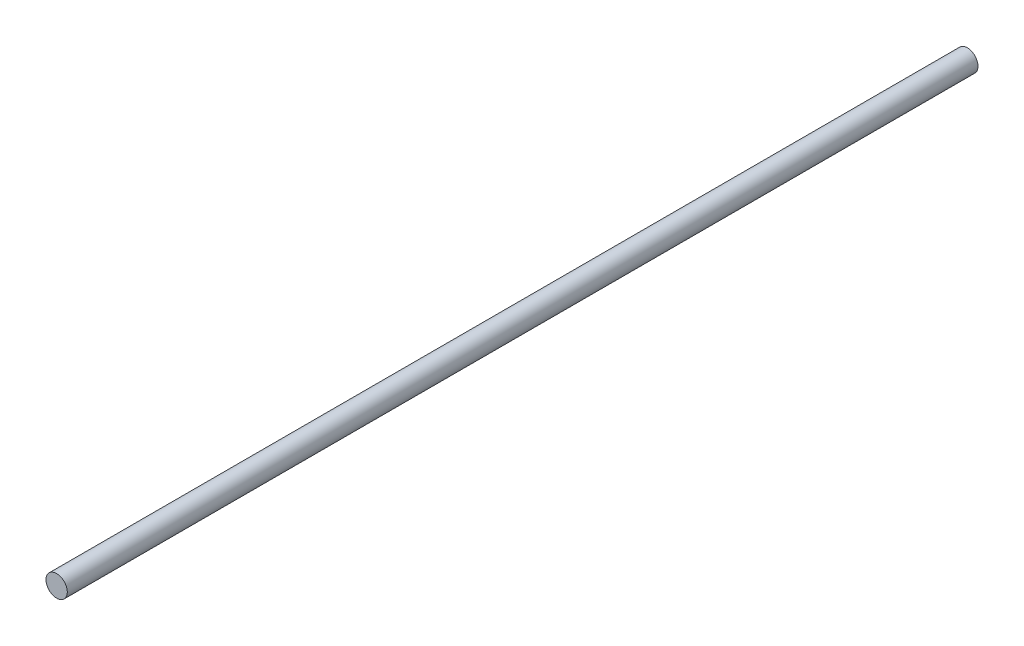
ISO-10303-21;
HEADER;
FILE_DESCRIPTION(('STEP AP214'),'2;1');
FILE_NAME('part.step','',(''),(''),'','','');
FILE_SCHEMA(('AUTOMOTIVE_DESIGN { 1 0 10303 214 1 1 1 1 }'));
ENDSEC;
DATA;
#1=APPLICATION_CONTEXT('core data for automotive mechanical design processes');
#2=APPLICATION_PROTOCOL_DEFINITION('international standard','automotive_design',2000,#1);
#3=PRODUCT_CONTEXT('',#1,'mechanical');
#4=PRODUCT('Part','Part','',(#3));
#5=PRODUCT_RELATED_PRODUCT_CATEGORY('part','',(#4));
#6=PRODUCT_DEFINITION_FORMATION('','',#4);
#7=PRODUCT_DEFINITION_CONTEXT('part definition',#1,'design');
#8=PRODUCT_DEFINITION('design','',#6,#7);
#9=PRODUCT_DEFINITION_SHAPE('','',#8);
#10=(LENGTH_UNIT() NAMED_UNIT(*) SI_UNIT(.MILLI.,.METRE.));
#11=(NAMED_UNIT(*) PLANE_ANGLE_UNIT() SI_UNIT($,.RADIAN.));
#12=(NAMED_UNIT(*) SI_UNIT($,.STERADIAN.) SOLID_ANGLE_UNIT());
#13=UNCERTAINTY_MEASURE_WITH_UNIT(LENGTH_MEASURE(1.E-05),#10,'distance_accuracy_value','');
#14=(GEOMETRIC_REPRESENTATION_CONTEXT(3) GLOBAL_UNCERTAINTY_ASSIGNED_CONTEXT((#13)) GLOBAL_UNIT_ASSIGNED_CONTEXT((#10,
#11,#12)) REPRESENTATION_CONTEXT('',''));
#15=CARTESIAN_POINT('',(0.,0.,0.));
#16=DIRECTION('',(0.,0.,1.));
#17=DIRECTION('',(1.,0.,0.));
#18=AXIS2_PLACEMENT_3D('',#15,#16,#17);
#19=CARTESIAN_POINT('',(0.,0.,88.9));
#20=DIRECTION('',(0.,0.,-1.));
#21=DIRECTION('',(-1.,0.,0.));
#22=AXIS2_PLACEMENT_3D('',#19,#20,#21);
#23=CYLINDRICAL_SURFACE('',#22,2.0828);
#24=CARTESIAN_POINT('',(0.,0.,88.9));
#25=DIRECTION('',(0.,0.,1.));
#26=DIRECTION('',(1.,0.,0.));
#27=AXIS2_PLACEMENT_3D('',#24,#25,#26);
#28=CIRCLE('',#27,2.0828);
#29=CARTESIAN_POINT('',(2.0828,0.,88.9));
#30=VERTEX_POINT('',#29);
#31=EDGE_CURVE('E10',#30,#30,#28,.T.);
#32=ORIENTED_EDGE('',*,*,#31,.F.);
#33=EDGE_LOOP('',(#32));
#34=FACE_BOUND('',#33,.T.);
#35=CARTESIAN_POINT('',(0.,0.,-88.9));
#36=DIRECTION('',(0.,0.,1.));
#37=DIRECTION('',(1.,0.,0.));
#38=AXIS2_PLACEMENT_3D('',#35,#36,#37);
#39=CIRCLE('',#38,2.0828);
#40=CARTESIAN_POINT('',(2.0828,0.,-88.9));
#41=VERTEX_POINT('',#40);
#42=EDGE_CURVE('E36',#41,#41,#39,.T.);
#43=ORIENTED_EDGE('',*,*,#42,.T.);
#44=EDGE_LOOP('',(#43));
#45=FACE_BOUND('',#44,.T.);
#46=ADVANCED_FACE('F33',(#34,#45),#23,.T.);
#47=CARTESIAN_POINT('',(0.,0.,88.9));
#48=DIRECTION('',(0.,0.,1.));
#49=DIRECTION('',(1.,0.,0.));
#50=AXIS2_PLACEMENT_3D('',#47,#48,#49);
#51=PLANE('',#50);
#52=ORIENTED_EDGE('',*,*,#31,.T.);
#53=EDGE_LOOP('',(#52));
#54=FACE_BOUND('',#53,.T.);
#55=ADVANCED_FACE('F48',(#54),#51,.T.);
#56=CARTESIAN_POINT('',(0.,0.,-88.9));
#57=DIRECTION('',(0.,0.,1.));
#58=DIRECTION('',(1.,0.,0.));
#59=AXIS2_PLACEMENT_3D('',#56,#57,#58);
#60=PLANE('',#59);
#61=ORIENTED_EDGE('',*,*,#42,.F.);
#62=EDGE_LOOP('',(#61));
#63=FACE_BOUND('',#62,.T.);
#64=ADVANCED_FACE('F46',(#63),#60,.F.);
#65=CLOSED_SHELL('',(#46,#55,#64));
#66=MANIFOLD_SOLID_BREP('B2',#65);
#67=ADVANCED_BREP_SHAPE_REPRESENTATION('',(#18,#66),#14);
#68=SHAPE_DEFINITION_REPRESENTATION(#9,#67);
ENDSEC;
END-ISO-10303-21;
